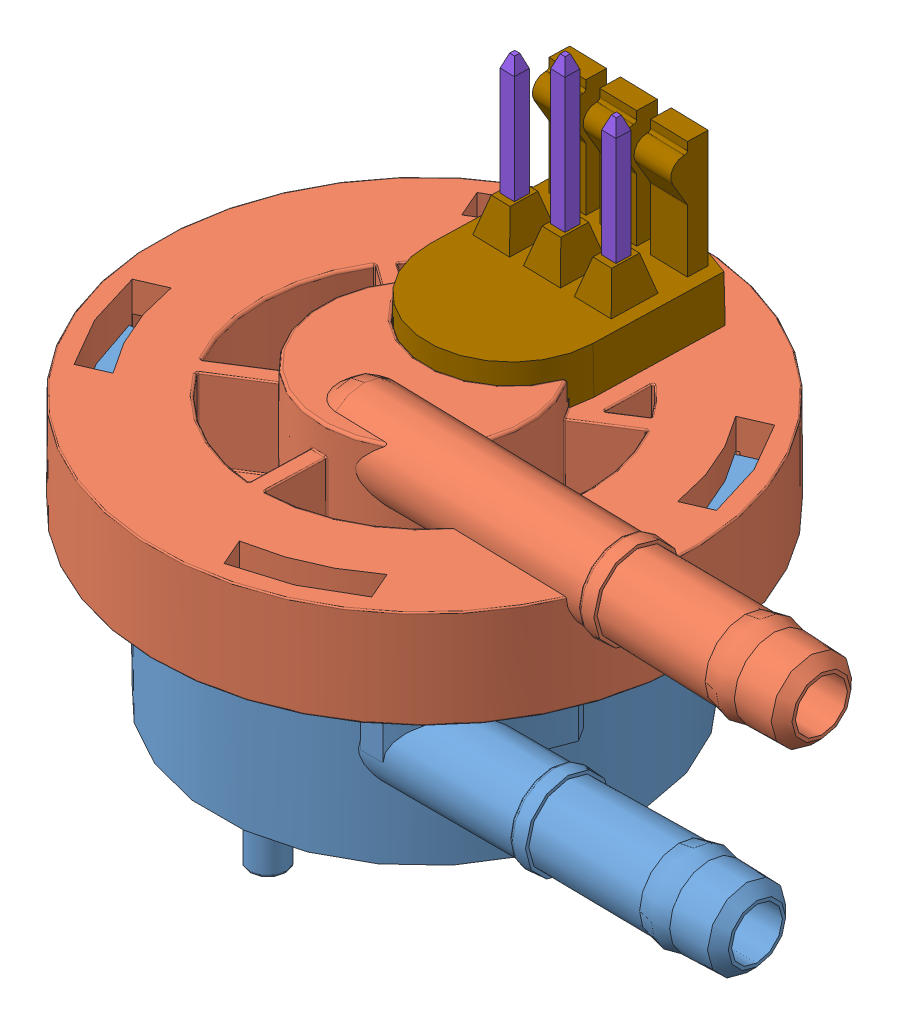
SolidWorks assembly ASS DEBITM  SW5.SLDASM, configuration Défaut (file format 4400). Lengths in mm.
Overall size (58.68 44.69 44.33).
12 component instances, 9 part files, 30 mates.
Components (placement in the parent):
- CORPS DEBITM SW5-1: CORPS DEBITM SW5.SLDPRT [Défaut] at (-6.1259 -6.6118 0) size (54.46 24.76 36.92)
- COUVERCLE DEBITM SW5-1: COUVERCLE DEBITM SW5.SLDPRT [Défaut] at (-6.1259 5.9132 0) x (-0.999663 0 -0.025978) z (0.025978 0 -0.999663) size (56.5 12.65 41)
- JOINT DEBITM SW5-1: JOINT DEBITM SW5.SLDPRT [Défaut] at (-6.1259 10.5632 0) x (0.585321 0 0.810802) z (-0.810802 0 0.585321) size (31.75 1.75 31.75)
- ROUE A AUBE DEBITM SW5-1: ROUE A AUBE DEBITM SW5.SLDPRT [Défaut] at (-6.1259 -4.8368 0) x (0.845405 0 0.534126) z (-0.534126 0 0.845405) size (24.05 14.4 26.9)
- AIMANT DEBITM SW5-1: AIMANT DEBITM SW5.SLDPRT [Défaut] at (-6.3235 7.8132 -2.9637) x (0.845405 0 0.534126) z (-0.534126 0 0.845405) size (3.5 3.85 2.5)
- AIMANT DEBITM SW5-2: AIMANT DEBITM SW5.SLDPRT [Défaut] at (-10.009 7.8132 2.8696) x (0.845405 0 0.534126) z (-0.534126 0 0.845405) size (3.5 3.85 2.5)
- PORTE CAPTEUR DEBITM SW5-1: PORTE CAPTEUR DEBITM SW5.SLDPRT [Défaut] at (-6.1259 13.4132 0) x (0.025978 0 -0.999663) z (0 -1 0) size (7.25 13.3 8.3)
- CAPTEUR DEBITM SW5-2: CAPTEUR DEBITM SW5.SLDPRT [Défaut] at (-6.1205 15.4132 -5.9819) x (-0.025978 0 0.999663) z (-0.999663 0 -0.025978) size (7 6.95 8.75)
- BROCHE DEBITM SW5-1: BROCHE DEBITM SW5.SLDPRT [Défaut] at (-9.8408 27.9132 -10.6401) x (-0.025978 0 0.999663) z (0 -1 0) size (1.12 1.12 19)
- BROCHE DEBITM SW5-2: BROCHE DEBITM SW5.SLDPRT [Défaut] at (-5.8621 12.9132 -10.5367) x (-0.025978 0 0.999663) z (0 1 0) size (1.12 1.12 19)
- BROCHE DEBITM SW5-3: BROCHE DEBITM SW5.SLDPRT [Défaut] at (-1.8435 10.9132 -10.4323) x (0.999663 0 0.025978) z (0 1 0) size (1.12 1.12 19)
- CACHE CAPTEUR DEBITM SW5-1: CACHE CAPTEUR DEBITM SW5.SLDPRT [Défaut] at (-5.9571 13.4132 -6.4978) x (-0.025978 0 0.999663) z (-0.999663 0 -0.025978) size (17.6 15.3 13)
Mates (geometry in assembly coordinates):
- Coaxiale1: concentric aligned: cylinder of CORPS DEBITM SW5-1 through (-6.1259 -6.6118 0) axis (0 -1 0) radius 16.85; cylinder of COUVERCLE DEBITM SW5-1 through (-6.1259 -11.8192 0) axis (0 -1 0) radius 19.2
- Coïncidente3: coincident aligned: axis of CORPS DEBITM SW5-1 through (-6.1259 -6.6118 0) axis (0 1 0); axis of JOINT DEBITM SW5-1 through (-6.1259 10.5632 0) axis (0 1 0)
- Tangent1: tangent: plane of CORPS DEBITM SW5-1 through (7.8741 9.6882 0) normal (0 1 0); face of JOINT DEBITM SW5-1
- Coïncidente5: coincident anti-aligned: plane of ROUE A AUBE DEBITM SW5-1 through (-3.3646 7.8132 -1.0943) normal (0 1 0); plane of AIMANT DEBITM SW5-1 through (-4.9882 7.8132 -5.0772) normal (0 -1 0)
- Coïncidente6: coincident anti-aligned: plane of ROUE A AUBE DEBITM SW5-1 through (-7.05 7.8132 4.739) normal (0 1 0); plane of AIMANT DEBITM SW5-2 through (-8.6736 7.8132 0.7561) normal (0 -1 0)
- Coïncidente7: coincident anti-aligned: plane of ROUE A AUBE DEBITM SW5-1 through (-7.05 7.8132 4.739) normal (0.534126 0 -0.845405); plane of AIMANT DEBITM SW5-2 through (-10.009 11.6632 2.8696) normal (-0.534126 0 0.845405)
- Coïncidente8: coincident anti-aligned: plane of ROUE A AUBE DEBITM SW5-1 through (-7.05 7.8132 4.739) normal (-0.845405 0 -0.534126); plane of AIMANT DEBITM SW5-2 through (-7.05 11.6632 4.739) normal (0.845405 0 0.534126)
- Coïncidente9: coincident anti-aligned: plane of ROUE A AUBE DEBITM SW5-1 through (-2.2429 7.8132 -2.8696) normal (-0.845405 0 -0.534126); plane of AIMANT DEBITM SW5-1 through (-3.3646 11.6632 -1.0943) normal (0.845405 0 0.534126)
- Coïncidente10: coincident anti-aligned: plane of ROUE A AUBE DEBITM SW5-1 through (-3.3646 7.8132 -1.0943) normal (0.534126 0 -0.845405); plane of AIMANT DEBITM SW5-1 through (-6.3235 11.6632 -2.9637) normal (-0.534126 0 0.845405)
- Coïncidente13: coincident aligned: axis of CORPS DEBITM SW5-1 through (-6.1259 -6.6118 0) axis (0 1 0); axis of ROUE A AUBE DEBITM SW5-1 through (-6.1259 -4.8368 0) axis (0 1 0)
- Coïncidente16: coincident aligned: cone of CORPS DEBITM SW5-1 through (-6.1259 9.5382 0) axis (0 1 0); cone of ROUE A AUBE DEBITM SW5-1 through (-6.1259 11.0132 0) axis (0 1 0)
- Coïncidente19: coincident: point of CORPS DEBITM SW5-1; plane of COUVERCLE DEBITM SW5-1 through (-6.1259 8.5132 0) normal (0 1 0)
- Coaxiale4: concentric anti-aligned: cylinder of COUVERCLE DEBITM SW5-1 through (-6.1259 -11.8192 0) axis (0 -1 0) radius 12.5; cylinder of PORTE CAPTEUR DEBITM SW5-1 through (-6.1259 8.1132 0) axis (0 1 0) radius 12.5
- Coïncidente20: coincident anti-aligned: plane of COUVERCLE DEBITM SW5-1 through (-12.2172 28.3573 -7.1106) normal (0.025978 0 -0.999663); plane of PORTE CAPTEUR DEBITM SW5-1 through (-0.4972 8.1132 -6.8061) normal (-0.025978 0 0.999663)
- Coïncidente21: coincident anti-aligned: plane of COUVERCLE DEBITM SW5-1 through (-18.6217 13.4132 -0.3247) normal (0 1 0); plane of PORTE CAPTEUR DEBITM SW5-1 through (-6.1259 13.4132 0) normal (0 -1 0)
- Coïncidente23: coincident: plane of PORTE CAPTEUR DEBITM SW5-1 through (-8.4368 15.9632 -7.3125) normal (0 1 0); line of CAPTEUR DEBITM SW5-2 through (-5.8323 15.9632 -9.3755) axis (-0.025978 0 0.999663)
- Distance2: distance = 0.2 mm anti-aligned: plane of PORTE CAPTEUR DEBITM SW5-1 through (-6.3874 9.4632 -11.1105) normal (0.999663 0 0.025978); plane of CAPTEUR DEBITM SW5-2 through (-6.2166 15.9632 -9.9857) normal (-0.999663 0 -0.025978)
- Coïncidente25: coincident anti-aligned: plane of PORTE CAPTEUR DEBITM SW5-1 through (-10.386 9.4632 -11.2145) normal (0.999663 0 0.025978); plane of BROCHE DEBITM SW5-1 through (-10.4151 10.9132 -10.0948) normal (-0.999663 0 -0.025978)
- Coïncidente26: coincident anti-aligned: plane of PORTE CAPTEUR DEBITM SW5-1 through (-10.386 9.4632 -11.2145) normal (-0.025978 0 0.999663); plane of BROCHE DEBITM SW5-1 through (-10.386 10.9132 -11.2145) normal (0.025978 0 -0.999663)
- Distance3: distance = 12.5 mm aligned: plane of PORTE CAPTEUR DEBITM SW5-1 through (-6.1259 16.4132 0) normal (0 1 0); plane of BROCHE DEBITM SW5-1 through (-9.2955 28.9132 -10.0657) normal (0 1 0)
- Coïncidente28: coincident anti-aligned: plane of PORTE CAPTEUR DEBITM SW5-1 through (-5.2878 9.4632 -11.082) normal (-0.999663 0 -0.025978); plane of BROCHE DEBITM SW5-2 through (-5.3169 29.9132 -9.9623) normal (0.999663 0 0.025978)
- Distance4: distance = 2 mm aligned: plane of BROCHE DEBITM SW5-1 through (-9.2955 28.9132 -10.0657) normal (0 1 0); plane of BROCHE DEBITM SW5-2 through (-5.3169 30.9132 -9.9623) normal (0 1 0)
- Coïncidente31: coincident anti-aligned: plane of PORTE CAPTEUR DEBITM SW5-1 through (-1.2891 9.4632 -10.9781) normal (-0.025978 0 0.999663); plane of BROCHE DEBITM SW5-3 through (-1.2691 27.9132 -10.9775) normal (0.025978 0 -0.999663)
- Coïncidente32: coincident anti-aligned: plane of PORTE CAPTEUR DEBITM SW5-1 through (-2.3887 9.4632 -11.0066) normal (0.999663 0 0.025978); plane of BROCHE DEBITM SW5-3 through (-2.3887 27.9132 -11.0066) normal (-0.999663 0 -0.025978)
- Coïncidente33: coincident aligned: plane of BROCHE DEBITM SW5-3 through (-1.2691 28.9132 -10.9775) normal (0 1 0); plane of BROCHE DEBITM SW5-1 through (-9.2955 28.9132 -10.0657) normal (0 1 0)
- Coïncidente34: coincident anti-aligned: plane of PORTE CAPTEUR DEBITM SW5-1 through (-5.2878 9.4632 -11.082) normal (-0.025978 0 0.999663); plane of BROCHE DEBITM SW5-2 through (-5.2878 29.9132 -11.082) normal (0.025978 0 -0.999663)
- Coaxiale5: concentric aligned: cylinder of COUVERCLE DEBITM SW5-1 through (-5.9571 14.0132 -6.4978) axis (0 1 0) radius 6.5; cone of CACHE CAPTEUR DEBITM SW5-1 through (-5.9571 13.4132 -6.4978) axis (0 1 0)
- Coïncidente40: coincident anti-aligned: plane of COUVERCLE DEBITM SW5-1 through (-18.6217 13.4132 -0.3247) normal (0 1 0); plane of CACHE CAPTEUR DEBITM SW5-1 through (-5.9571 13.4132 -6.4978) normal (0 -1 0)
- Parallèle4: parallel: line of COUVERCLE DEBITM SW5-1 through (0.42 14.0132 -10.3835) axis (0.025978 0 -0.999663); plane of CACHE CAPTEUR DEBITM SW5-1 through (0.5407 13.4132 -6.3289) normal (0.99951 0.017452 0.025974)
- Coïncidente42: coincident anti-aligned: plane of CAPTEUR DEBITM SW5-2 through (-5.8167 15.9632 -9.9753) normal (0.025978 0 -0.999663); plane of BROCHE DEBITM SW5-2 through (-6.4365 29.9132 -9.9914) normal (-0.025978 0 0.999663)
